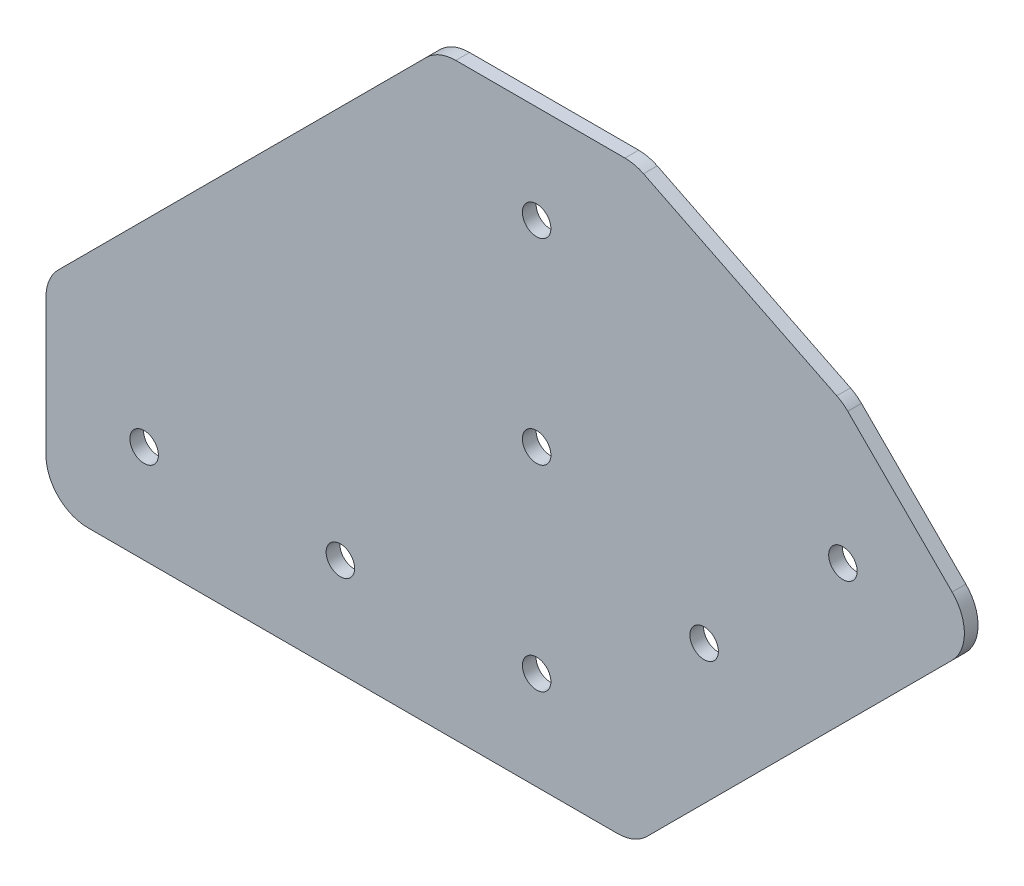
ISO-10303-21;
HEADER;
FILE_DESCRIPTION(('STEP AP214'),'2;1');
FILE_NAME('part.step','',(''),(''),'','','');
FILE_SCHEMA(('AUTOMOTIVE_DESIGN { 1 0 10303 214 1 1 1 1 }'));
ENDSEC;
DATA;
#1=APPLICATION_CONTEXT('core data for automotive mechanical design processes');
#2=APPLICATION_PROTOCOL_DEFINITION('international standard','automotive_design',2000,#1);
#3=PRODUCT_CONTEXT('',#1,'mechanical');
#4=PRODUCT('Part','Part','',(#3));
#5=PRODUCT_RELATED_PRODUCT_CATEGORY('part','',(#4));
#6=PRODUCT_DEFINITION_FORMATION('','',#4);
#7=PRODUCT_DEFINITION_CONTEXT('part definition',#1,'design');
#8=PRODUCT_DEFINITION('design','',#6,#7);
#9=PRODUCT_DEFINITION_SHAPE('','',#8);
#10=(LENGTH_UNIT() NAMED_UNIT(*) SI_UNIT(.MILLI.,.METRE.));
#11=(NAMED_UNIT(*) PLANE_ANGLE_UNIT() SI_UNIT($,.RADIAN.));
#12=(NAMED_UNIT(*) SI_UNIT($,.STERADIAN.) SOLID_ANGLE_UNIT());
#13=UNCERTAINTY_MEASURE_WITH_UNIT(LENGTH_MEASURE(1.E-05),#10,'distance_accuracy_value','');
#14=(GEOMETRIC_REPRESENTATION_CONTEXT(3) GLOBAL_UNCERTAINTY_ASSIGNED_CONTEXT((#13)) GLOBAL_UNIT_ASSIGNED_CONTEXT((#10,
#11,#12)) REPRESENTATION_CONTEXT('',''));
#15=CARTESIAN_POINT('',(0.,0.,0.));
#16=DIRECTION('',(0.,0.,1.));
#17=DIRECTION('',(1.,0.,0.));
#18=AXIS2_PLACEMENT_3D('',#15,#16,#17);
#19=CARTESIAN_POINT('',(0.,0.,0.));
#20=DIRECTION('',(0.,0.,1.));
#21=DIRECTION('',(1.,0.,0.));
#22=AXIS2_PLACEMENT_3D('',#19,#20,#21);
#23=PLANE('',#22);
#24=CARTESIAN_POINT('',(66.1934297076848,4.841875,0.));
#25=DIRECTION('',(0.,0.,-1.));
#26=DIRECTION('',(-1.,0.,0.));
#27=AXIS2_PLACEMENT_3D('',#24,#25,#26);
#28=CIRCLE('',#27,4.841875);
#29=CARTESIAN_POINT('',(66.1934297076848,0.,0.));
#30=VERTEX_POINT('',#29);
#31=CARTESIAN_POINT('',(69.6171523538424,1.4181523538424,0.));
#32=VERTEX_POINT('',#31);
#33=EDGE_CURVE('E122',#30,#32,#28,.F.);
#34=ORIENTED_EDGE('',*,*,#33,.F.);
#35=DIRECTION('',(1.,0.,0.));
#36=VECTOR('',#35,1.);
#37=CARTESIAN_POINT('',(0.,0.,0.));
#38=LINE('',#37,#36);
#39=CARTESIAN_POINT('',(4.841875,0.,0.));
#40=VERTEX_POINT('',#39);
#41=EDGE_CURVE('E114',#30,#40,#38,.F.);
#42=ORIENTED_EDGE('',*,*,#41,.T.);
#43=CARTESIAN_POINT('',(4.841875,4.841875,0.));
#44=DIRECTION('',(0.,0.,-1.));
#45=DIRECTION('',(-1.,0.,0.));
#46=AXIS2_PLACEMENT_3D('',#43,#44,#45);
#47=CIRCLE('',#46,4.841875);
#48=CARTESIAN_POINT('',(0.,4.841875,0.));
#49=VERTEX_POINT('',#48);
#50=EDGE_CURVE('E212',#49,#40,#47,.F.);
#51=ORIENTED_EDGE('',*,*,#50,.F.);
#52=DIRECTION('',(0.,1.,0.));
#53=VECTOR('',#52,1.);
#54=CARTESIAN_POINT('',(0.,22.733,0.));
#55=LINE('',#54,#53);
#56=CARTESIAN_POINT('',(0.,20.7274297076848,0.));
#57=VERTEX_POINT('',#56);
#58=EDGE_CURVE('E149',#49,#57,#55,.T.);
#59=ORIENTED_EDGE('',*,*,#58,.T.);
#60=CARTESIAN_POINT('',(4.841875,20.7274297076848,0.));
#61=DIRECTION('',(0.,0.,-1.));
#62=DIRECTION('',(-1.,0.,0.));
#63=AXIS2_PLACEMENT_3D('',#60,#61,#62);
#64=CIRCLE('',#63,4.841875);
#65=CARTESIAN_POINT('',(1.41815235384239,24.1511523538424,0.));
#66=VERTEX_POINT('',#65);
#67=EDGE_CURVE('E215',#66,#57,#64,.F.);
#68=ORIENTED_EDGE('',*,*,#67,.F.);
#69=DIRECTION('',(0.707106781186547,0.707106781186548,0.));
#70=VECTOR('',#69,1.);
#71=CARTESIAN_POINT('',(45.466,68.199,0.));
#72=LINE('',#71,#70);
#73=CARTESIAN_POINT('',(44.0478476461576,66.7808476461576,0.));
#74=VERTEX_POINT('',#73);
#75=EDGE_CURVE('E153',#66,#74,#72,.T.);
#76=ORIENTED_EDGE('',*,*,#75,.T.);
#77=CARTESIAN_POINT('',(47.4715702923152,63.357125,0.));
#78=DIRECTION('',(0.,0.,-1.));
#79=DIRECTION('',(-1.,0.,0.));
#80=AXIS2_PLACEMENT_3D('',#77,#78,#79);
#81=CIRCLE('',#80,4.841875);
#82=CARTESIAN_POINT('',(47.4715702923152,68.199,0.));
#83=VERTEX_POINT('',#82);
#84=EDGE_CURVE('E156',#83,#74,#81,.F.);
#85=ORIENTED_EDGE('',*,*,#84,.F.);
#86=DIRECTION('',(1.,0.,0.));
#87=VECTOR('',#86,1.);
#88=CARTESIAN_POINT('',(68.199,68.199,0.));
#89=LINE('',#88,#87);
#90=CARTESIAN_POINT('',(67.0660350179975,68.199,0.));
#91=VERTEX_POINT('',#90);
#92=EDGE_CURVE('E157',#83,#91,#89,.T.);
#93=ORIENTED_EDGE('',*,*,#92,.T.);
#94=CARTESIAN_POINT('',(67.0660350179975,63.357125,0.));
#95=DIRECTION('',(0.,0.,-1.));
#96=DIRECTION('',(-1.,0.,0.));
#97=AXIS2_PLACEMENT_3D('',#94,#95,#96);
#98=CIRCLE('',#97,4.841875);
#99=CARTESIAN_POINT('',(69.2143394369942,67.6963117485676,0.));
#100=VERTEX_POINT('',#99);
#101=EDGE_CURVE('E160',#100,#91,#98,.F.);
#102=ORIENTED_EDGE('',*,*,#101,.F.);
#103=DIRECTION('',(0.896179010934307,-0.443692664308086,0.));
#104=VECTOR('',#103,1.);
#105=CARTESIAN_POINT('',(92.3109876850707,56.2613045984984,0.));
#106=LINE('',#105,#104);
#107=CARTESIAN_POINT('',(91.5980748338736,56.6142633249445,0.));
#108=VERTEX_POINT('',#107);
#109=EDGE_CURVE('E161',#100,#108,#106,.T.);
#110=ORIENTED_EDGE('',*,*,#109,.T.);
#111=CARTESIAN_POINT('',(89.4497704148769,52.2750765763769,0.));
#112=DIRECTION('',(0.,0.,-1.));
#113=DIRECTION('',(-1.,0.,0.));
#114=AXIS2_PLACEMENT_3D('',#111,#112,#113);
#115=CIRCLE('',#114,4.841875);
#116=CARTESIAN_POINT('',(92.8734930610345,55.6987992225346,0.));
#117=VERTEX_POINT('',#116);
#118=EDGE_CURVE('E164',#117,#108,#115,.F.);
#119=ORIENTED_EDGE('',*,*,#118,.F.);
#120=DIRECTION('',(0.707106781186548,-0.707106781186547,0.));
#121=VECTOR('',#120,1.);
#122=CARTESIAN_POINT('',(108.385646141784,40.1866461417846,0.));
#123=LINE('',#122,#121);
#124=CARTESIAN_POINT('',(104.961923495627,43.6103687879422,0.));
#125=VERTEX_POINT('',#124);
#126=EDGE_CURVE('E165',#117,#125,#123,.T.);
#127=ORIENTED_EDGE('',*,*,#126,.T.);
#128=CARTESIAN_POINT('',(101.538200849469,40.1866461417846,0.));
#129=DIRECTION('',(0.,0.,-1.));
#130=DIRECTION('',(-1.,0.,0.));
#131=AXIS2_PLACEMENT_3D('',#128,#129,#130);
#132=CIRCLE('',#131,4.841875);
#133=CARTESIAN_POINT('',(104.961923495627,36.762923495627,0.));
#134=VERTEX_POINT('',#133);
#135=EDGE_CURVE('E125',#134,#125,#132,.F.);
#136=ORIENTED_EDGE('',*,*,#135,.F.);
#137=DIRECTION('',(-0.707106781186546,-0.707106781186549,0.));
#138=VECTOR('',#137,1.);
#139=CARTESIAN_POINT('',(68.199,0.,0.));
#140=LINE('',#139,#138);
#141=EDGE_CURVE('E119',#134,#32,#140,.T.);
#142=ORIENTED_EDGE('',*,*,#141,.T.);
#143=EDGE_LOOP('',(#34,#42,#51,#59,#68,#76,#85,#93,#102,#110,#119,#127,#136,#142));
#144=FACE_BOUND('',#143,.T.);
#145=CARTESIAN_POINT('',(56.8325,11.3665,0.));
#146=DIRECTION('',(0.,0.,1.));
#147=DIRECTION('',(1.,0.,0.));
#148=AXIS2_PLACEMENT_3D('',#145,#146,#147);
#149=CIRCLE('',#148,1.65099999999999);
#150=CARTESIAN_POINT('',(58.4835,11.3665,0.));
#151=VERTEX_POINT('',#150);
#152=EDGE_CURVE('E148',#151,#151,#149,.T.);
#153=ORIENTED_EDGE('',*,*,#152,.T.);
#154=EDGE_LOOP('',(#153));
#155=FACE_BOUND('',#154,.T.);
#156=CARTESIAN_POINT('',(92.3109876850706,40.1866461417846,0.));
#157=DIRECTION('',(0.,0.,1.));
#158=DIRECTION('',(1.,0.,0.));
#159=AXIS2_PLACEMENT_3D('',#156,#157,#158);
#160=CIRCLE('',#159,1.65099999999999);
#161=CARTESIAN_POINT('',(93.9619876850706,40.1866461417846,0.));
#162=VERTEX_POINT('',#161);
#163=EDGE_CURVE('E230',#162,#162,#160,.T.);
#164=ORIENTED_EDGE('',*,*,#163,.T.);
#165=EDGE_LOOP('',(#164));
#166=FACE_BOUND('',#165,.T.);
#167=CARTESIAN_POINT('',(76.2363292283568,24.1119876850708,0.));
#168=DIRECTION('',(0.,0.,1.));
#169=DIRECTION('',(1.,0.,0.));
#170=AXIS2_PLACEMENT_3D('',#167,#168,#169);
#171=CIRCLE('',#170,1.65099999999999);
#172=CARTESIAN_POINT('',(77.8873292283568,24.1119876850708,0.));
#173=VERTEX_POINT('',#172);
#174=EDGE_CURVE('E233',#173,#173,#171,.T.);
#175=ORIENTED_EDGE('',*,*,#174,.T.);
#176=EDGE_LOOP('',(#175));
#177=FACE_BOUND('',#176,.T.);
#178=CARTESIAN_POINT('',(34.0995,11.3665,0.));
#179=DIRECTION('',(0.,0.,1.));
#180=DIRECTION('',(1.,0.,0.));
#181=AXIS2_PLACEMENT_3D('',#178,#179,#180);
#182=CIRCLE('',#181,1.65099999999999);
#183=CARTESIAN_POINT('',(35.7505,11.3665,0.));
#184=VERTEX_POINT('',#183);
#185=EDGE_CURVE('E236',#184,#184,#182,.T.);
#186=ORIENTED_EDGE('',*,*,#185,.T.);
#187=EDGE_LOOP('',(#186));
#188=FACE_BOUND('',#187,.T.);
#189=CARTESIAN_POINT('',(11.3665,11.3665,0.));
#190=DIRECTION('',(0.,0.,1.));
#191=DIRECTION('',(1.,0.,0.));
#192=AXIS2_PLACEMENT_3D('',#189,#190,#191);
#193=CIRCLE('',#192,1.65099999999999);
#194=CARTESIAN_POINT('',(13.0175,11.3665,0.));
#195=VERTEX_POINT('',#194);
#196=EDGE_CURVE('E239',#195,#195,#193,.T.);
#197=ORIENTED_EDGE('',*,*,#196,.T.);
#198=EDGE_LOOP('',(#197));
#199=FACE_BOUND('',#198,.T.);
#200=CARTESIAN_POINT('',(56.8325,34.0995,0.));
#201=DIRECTION('',(0.,0.,1.));
#202=DIRECTION('',(1.,0.,0.));
#203=AXIS2_PLACEMENT_3D('',#200,#201,#202);
#204=CIRCLE('',#203,1.65099999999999);
#205=CARTESIAN_POINT('',(58.4835,34.0995,0.));
#206=VERTEX_POINT('',#205);
#207=EDGE_CURVE('E241',#206,#206,#204,.T.);
#208=ORIENTED_EDGE('',*,*,#207,.T.);
#209=EDGE_LOOP('',(#208));
#210=FACE_BOUND('',#209,.T.);
#211=CARTESIAN_POINT('',(56.8325,56.8325,0.));
#212=DIRECTION('',(0.,0.,1.));
#213=DIRECTION('',(1.,0.,0.));
#214=AXIS2_PLACEMENT_3D('',#211,#212,#213);
#215=CIRCLE('',#214,1.65099999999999);
#216=CARTESIAN_POINT('',(58.4835,56.8325,0.));
#217=VERTEX_POINT('',#216);
#218=EDGE_CURVE('E20',#217,#217,#215,.T.);
#219=ORIENTED_EDGE('',*,*,#218,.T.);
#220=EDGE_LOOP('',(#219));
#221=FACE_BOUND('',#220,.T.);
#222=ADVANCED_FACE('F17',(#144,#155,#166,#177,#188,#199,#210,#221),#23,.F.);
#223=CARTESIAN_POINT('',(56.8325,56.8325,1.5875));
#224=DIRECTION('',(0.,0.,1.));
#225=DIRECTION('',(1.,0.,0.));
#226=AXIS2_PLACEMENT_3D('',#223,#224,#225);
#227=CYLINDRICAL_SURFACE('',#226,1.65099999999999);
#228=CARTESIAN_POINT('',(56.8325,56.8325,1.5875));
#229=DIRECTION('',(0.,0.,1.));
#230=DIRECTION('',(1.,0.,0.));
#231=AXIS2_PLACEMENT_3D('',#228,#229,#230);
#232=CIRCLE('',#231,1.65099999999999);
#233=CARTESIAN_POINT('',(58.4835,56.8325,1.5875));
#234=VERTEX_POINT('',#233);
#235=EDGE_CURVE('E208',#234,#234,#232,.F.);
#236=ORIENTED_EDGE('',*,*,#235,.F.);
#237=EDGE_LOOP('',(#236));
#238=FACE_BOUND('',#237,.T.);
#239=ORIENTED_EDGE('',*,*,#218,.F.);
#240=EDGE_LOOP('',(#239));
#241=FACE_BOUND('',#240,.T.);
#242=ADVANCED_FACE('F249',(#238,#241),#227,.F.);
#243=CARTESIAN_POINT('',(56.8325,34.0995,1.5875));
#244=DIRECTION('',(0.,0.,1.));
#245=DIRECTION('',(1.,0.,0.));
#246=AXIS2_PLACEMENT_3D('',#243,#244,#245);
#247=CYLINDRICAL_SURFACE('',#246,1.65099999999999);
#248=CARTESIAN_POINT('',(56.8325,34.0995,1.5875));
#249=DIRECTION('',(0.,0.,1.));
#250=DIRECTION('',(1.,0.,0.));
#251=AXIS2_PLACEMENT_3D('',#248,#249,#250);
#252=CIRCLE('',#251,1.65099999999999);
#253=CARTESIAN_POINT('',(58.4835,34.0995,1.5875));
#254=VERTEX_POINT('',#253);
#255=EDGE_CURVE('E205',#254,#254,#252,.F.);
#256=ORIENTED_EDGE('',*,*,#255,.F.);
#257=EDGE_LOOP('',(#256));
#258=FACE_BOUND('',#257,.T.);
#259=ORIENTED_EDGE('',*,*,#207,.F.);
#260=EDGE_LOOP('',(#259));
#261=FACE_BOUND('',#260,.T.);
#262=ADVANCED_FACE('F251',(#258,#261),#247,.F.);
#263=CARTESIAN_POINT('',(11.3665,11.3665,1.5875));
#264=DIRECTION('',(0.,0.,1.));
#265=DIRECTION('',(1.,0.,0.));
#266=AXIS2_PLACEMENT_3D('',#263,#264,#265);
#267=CYLINDRICAL_SURFACE('',#266,1.65099999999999);
#268=CARTESIAN_POINT('',(11.3665,11.3665,1.5875));
#269=DIRECTION('',(0.,0.,1.));
#270=DIRECTION('',(1.,0.,0.));
#271=AXIS2_PLACEMENT_3D('',#268,#269,#270);
#272=CIRCLE('',#271,1.65099999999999);
#273=CARTESIAN_POINT('',(13.0175,11.3665,1.5875));
#274=VERTEX_POINT('',#273);
#275=EDGE_CURVE('E202',#274,#274,#272,.F.);
#276=ORIENTED_EDGE('',*,*,#275,.F.);
#277=EDGE_LOOP('',(#276));
#278=FACE_BOUND('',#277,.T.);
#279=ORIENTED_EDGE('',*,*,#196,.F.);
#280=EDGE_LOOP('',(#279));
#281=FACE_BOUND('',#280,.T.);
#282=ADVANCED_FACE('F258',(#278,#281),#267,.F.);
#283=CARTESIAN_POINT('',(34.0995,11.3665,1.5875));
#284=DIRECTION('',(0.,0.,1.));
#285=DIRECTION('',(1.,0.,0.));
#286=AXIS2_PLACEMENT_3D('',#283,#284,#285);
#287=CYLINDRICAL_SURFACE('',#286,1.65099999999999);
#288=CARTESIAN_POINT('',(34.0995,11.3665,1.5875));
#289=DIRECTION('',(0.,0.,1.));
#290=DIRECTION('',(1.,0.,0.));
#291=AXIS2_PLACEMENT_3D('',#288,#289,#290);
#292=CIRCLE('',#291,1.65099999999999);
#293=CARTESIAN_POINT('',(35.7505,11.3665,1.5875));
#294=VERTEX_POINT('',#293);
#295=EDGE_CURVE('E199',#294,#294,#292,.F.);
#296=ORIENTED_EDGE('',*,*,#295,.F.);
#297=EDGE_LOOP('',(#296));
#298=FACE_BOUND('',#297,.T.);
#299=ORIENTED_EDGE('',*,*,#185,.F.);
#300=EDGE_LOOP('',(#299));
#301=FACE_BOUND('',#300,.T.);
#302=ADVANCED_FACE('F332',(#298,#301),#287,.F.);
#303=CARTESIAN_POINT('',(76.2363292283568,24.1119876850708,1.5875));
#304=DIRECTION('',(0.,0.,1.));
#305=DIRECTION('',(1.,0.,0.));
#306=AXIS2_PLACEMENT_3D('',#303,#304,#305);
#307=CYLINDRICAL_SURFACE('',#306,1.65099999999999);
#308=CARTESIAN_POINT('',(76.2363292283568,24.1119876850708,1.5875));
#309=DIRECTION('',(0.,0.,1.));
#310=DIRECTION('',(1.,0.,0.));
#311=AXIS2_PLACEMENT_3D('',#308,#309,#310);
#312=CIRCLE('',#311,1.65099999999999);
#313=CARTESIAN_POINT('',(77.8873292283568,24.1119876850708,1.5875));
#314=VERTEX_POINT('',#313);
#315=EDGE_CURVE('E196',#314,#314,#312,.F.);
#316=ORIENTED_EDGE('',*,*,#315,.F.);
#317=EDGE_LOOP('',(#316));
#318=FACE_BOUND('',#317,.T.);
#319=ORIENTED_EDGE('',*,*,#174,.F.);
#320=EDGE_LOOP('',(#319));
#321=FACE_BOUND('',#320,.T.);
#322=ADVANCED_FACE('F328',(#318,#321),#307,.F.);
#323=CARTESIAN_POINT('',(92.3109876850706,40.1866461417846,1.5875));
#324=DIRECTION('',(0.,0.,1.));
#325=DIRECTION('',(1.,0.,0.));
#326=AXIS2_PLACEMENT_3D('',#323,#324,#325);
#327=CYLINDRICAL_SURFACE('',#326,1.65099999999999);
#328=CARTESIAN_POINT('',(92.3109876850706,40.1866461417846,1.5875));
#329=DIRECTION('',(0.,0.,1.));
#330=DIRECTION('',(1.,0.,0.));
#331=AXIS2_PLACEMENT_3D('',#328,#329,#330);
#332=CIRCLE('',#331,1.65099999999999);
#333=CARTESIAN_POINT('',(93.9619876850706,40.1866461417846,1.5875));
#334=VERTEX_POINT('',#333);
#335=EDGE_CURVE('E193',#334,#334,#332,.F.);
#336=ORIENTED_EDGE('',*,*,#335,.F.);
#337=EDGE_LOOP('',(#336));
#338=FACE_BOUND('',#337,.T.);
#339=ORIENTED_EDGE('',*,*,#163,.F.);
#340=EDGE_LOOP('',(#339));
#341=FACE_BOUND('',#340,.T.);
#342=ADVANCED_FACE('F324',(#338,#341),#327,.F.);
#343=CARTESIAN_POINT('',(56.8325,11.3665,1.5875));
#344=DIRECTION('',(0.,0.,1.));
#345=DIRECTION('',(1.,0.,0.));
#346=AXIS2_PLACEMENT_3D('',#343,#344,#345);
#347=CYLINDRICAL_SURFACE('',#346,1.65099999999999);
#348=CARTESIAN_POINT('',(56.8325,11.3665,1.5875));
#349=DIRECTION('',(0.,0.,1.));
#350=DIRECTION('',(1.,0.,0.));
#351=AXIS2_PLACEMENT_3D('',#348,#349,#350);
#352=CIRCLE('',#351,1.65099999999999);
#353=CARTESIAN_POINT('',(58.4835,11.3665,1.5875));
#354=VERTEX_POINT('',#353);
#355=EDGE_CURVE('E190',#354,#354,#352,.F.);
#356=ORIENTED_EDGE('',*,*,#355,.F.);
#357=EDGE_LOOP('',(#356));
#358=FACE_BOUND('',#357,.T.);
#359=ORIENTED_EDGE('',*,*,#152,.F.);
#360=EDGE_LOOP('',(#359));
#361=FACE_BOUND('',#360,.T.);
#362=ADVANCED_FACE('F321',(#358,#361),#347,.F.);
#363=CARTESIAN_POINT('',(0.,0.,1.5875));
#364=DIRECTION('',(0.,1.,0.));
#365=DIRECTION('',(0.,0.,1.));
#366=AXIS2_PLACEMENT_3D('',#363,#364,#365);
#367=PLANE('',#366);
#368=DIRECTION('',(0.,0.,-1.));
#369=VECTOR('',#368,1.);
#370=CARTESIAN_POINT('',(66.1934297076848,0.,1.5875));
#371=LINE('',#370,#369);
#372=CARTESIAN_POINT('',(66.1934297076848,0.,1.5875));
#373=VERTEX_POINT('',#372);
#374=EDGE_CURVE('E135',#373,#30,#371,.T.);
#375=ORIENTED_EDGE('',*,*,#374,.F.);
#376=DIRECTION('',(1.,0.,0.));
#377=VECTOR('',#376,1.);
#378=CARTESIAN_POINT('',(0.,0.,1.5875));
#379=LINE('',#378,#377);
#380=CARTESIAN_POINT('',(4.841875,0.,1.5875));
#381=VERTEX_POINT('',#380);
#382=EDGE_CURVE('E189',#381,#373,#379,.T.);
#383=ORIENTED_EDGE('',*,*,#382,.F.);
#384=DIRECTION('',(0.,0.,-1.));
#385=VECTOR('',#384,1.);
#386=CARTESIAN_POINT('',(4.841875,0.,1.5875));
#387=LINE('',#386,#385);
#388=EDGE_CURVE('E211',#40,#381,#387,.F.);
#389=ORIENTED_EDGE('',*,*,#388,.F.);
#390=ORIENTED_EDGE('',*,*,#41,.F.);
#391=EDGE_LOOP('',(#375,#383,#389,#390));
#392=FACE_BOUND('',#391,.T.);
#393=ADVANCED_FACE('F318',(#392),#367,.F.);
#394=CARTESIAN_POINT('',(66.1934297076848,4.841875,1.5875));
#395=DIRECTION('',(0.,0.,-1.));
#396=DIRECTION('',(-1.,0.,0.));
#397=AXIS2_PLACEMENT_3D('',#394,#395,#396);
#398=CYLINDRICAL_SURFACE('',#397,4.841875);
#399=ORIENTED_EDGE('',*,*,#33,.T.);
#400=DIRECTION('',(0.,0.,1.));
#401=VECTOR('',#400,1.);
#402=CARTESIAN_POINT('',(69.6171523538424,1.4181523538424,1.5875));
#403=LINE('',#402,#401);
#404=CARTESIAN_POINT('',(69.6171523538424,1.4181523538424,1.5875));
#405=VERTEX_POINT('',#404);
#406=EDGE_CURVE('E129',#32,#405,#403,.T.);
#407=ORIENTED_EDGE('',*,*,#406,.T.);
#408=CARTESIAN_POINT('',(66.1934297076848,4.841875,1.5875));
#409=DIRECTION('',(0.,0.,-1.));
#410=DIRECTION('',(-1.,0.,0.));
#411=AXIS2_PLACEMENT_3D('',#408,#409,#410);
#412=CIRCLE('',#411,4.841875);
#413=EDGE_CURVE('E187',#373,#405,#412,.F.);
#414=ORIENTED_EDGE('',*,*,#413,.F.);
#415=ORIENTED_EDGE('',*,*,#374,.T.);
#416=EDGE_LOOP('',(#399,#407,#414,#415));
#417=FACE_BOUND('',#416,.T.);
#418=ADVANCED_FACE('F132',(#417),#398,.T.);
#419=CARTESIAN_POINT('',(68.199,0.,1.5875));
#420=DIRECTION('',(-0.707106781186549,0.707106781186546,0.));
#421=DIRECTION('',(-0.707106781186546,-0.707106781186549,0.));
#422=AXIS2_PLACEMENT_3D('',#419,#420,#421);
#423=PLANE('',#422);
#424=ORIENTED_EDGE('',*,*,#406,.F.);
#425=ORIENTED_EDGE('',*,*,#141,.F.);
#426=DIRECTION('',(0.,0.,-1.));
#427=VECTOR('',#426,1.);
#428=CARTESIAN_POINT('',(104.961923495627,36.762923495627,1.5875));
#429=LINE('',#428,#427);
#430=CARTESIAN_POINT('',(104.961923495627,36.762923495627,1.5875));
#431=VERTEX_POINT('',#430);
#432=EDGE_CURVE('E141',#431,#134,#429,.T.);
#433=ORIENTED_EDGE('',*,*,#432,.F.);
#434=DIRECTION('',(0.707106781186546,0.707106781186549,0.));
#435=VECTOR('',#434,1.);
#436=CARTESIAN_POINT('',(69.6171523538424,1.4181523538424,1.5875));
#437=LINE('',#436,#435);
#438=EDGE_CURVE('E139',#405,#431,#437,.T.);
#439=ORIENTED_EDGE('',*,*,#438,.F.);
#440=EDGE_LOOP('',(#424,#425,#433,#439));
#441=FACE_BOUND('',#440,.T.);
#442=ADVANCED_FACE('F137',(#441),#423,.F.);
#443=CARTESIAN_POINT('',(101.538200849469,40.1866461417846,1.5875));
#444=DIRECTION('',(0.,0.,-1.));
#445=DIRECTION('',(-1.,0.,0.));
#446=AXIS2_PLACEMENT_3D('',#443,#444,#445);
#447=CYLINDRICAL_SURFACE('',#446,4.841875);
#448=ORIENTED_EDGE('',*,*,#135,.T.);
#449=DIRECTION('',(0.,0.,1.));
#450=VECTOR('',#449,1.);
#451=CARTESIAN_POINT('',(104.961923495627,43.6103687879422,1.5875));
#452=LINE('',#451,#450);
#453=CARTESIAN_POINT('',(104.961923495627,43.6103687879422,1.5875));
#454=VERTEX_POINT('',#453);
#455=EDGE_CURVE('E166',#125,#454,#452,.T.);
#456=ORIENTED_EDGE('',*,*,#455,.T.);
#457=CARTESIAN_POINT('',(101.538200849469,40.1866461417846,1.5875));
#458=DIRECTION('',(0.,0.,-1.));
#459=DIRECTION('',(-1.,0.,0.));
#460=AXIS2_PLACEMENT_3D('',#457,#458,#459);
#461=CIRCLE('',#460,4.841875);
#462=EDGE_CURVE('E184',#431,#454,#461,.F.);
#463=ORIENTED_EDGE('',*,*,#462,.F.);
#464=ORIENTED_EDGE('',*,*,#432,.T.);
#465=EDGE_LOOP('',(#448,#456,#463,#464));
#466=FACE_BOUND('',#465,.T.);
#467=ADVANCED_FACE('F309',(#466),#447,.T.);
#468=CARTESIAN_POINT('',(108.385646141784,40.1866461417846,1.5875));
#469=DIRECTION('',(-0.707106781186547,-0.707106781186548,0.));
#470=DIRECTION('',(0.707106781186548,-0.707106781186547,0.));
#471=AXIS2_PLACEMENT_3D('',#468,#469,#470);
#472=PLANE('',#471);
#473=ORIENTED_EDGE('',*,*,#455,.F.);
#474=ORIENTED_EDGE('',*,*,#126,.F.);
#475=DIRECTION('',(0.,0.,-1.));
#476=VECTOR('',#475,1.);
#477=CARTESIAN_POINT('',(92.8734930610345,55.6987992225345,1.5875));
#478=LINE('',#477,#476);
#479=CARTESIAN_POINT('',(92.8734930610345,55.6987992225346,1.5875));
#480=VERTEX_POINT('',#479);
#481=EDGE_CURVE('E226',#480,#117,#478,.T.);
#482=ORIENTED_EDGE('',*,*,#481,.F.);
#483=DIRECTION('',(-0.707106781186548,0.707106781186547,0.));
#484=VECTOR('',#483,1.);
#485=CARTESIAN_POINT('',(104.961923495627,43.6103687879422,1.5875));
#486=LINE('',#485,#484);
#487=EDGE_CURVE('E183',#454,#480,#486,.T.);
#488=ORIENTED_EDGE('',*,*,#487,.F.);
#489=EDGE_LOOP('',(#473,#474,#482,#488));
#490=FACE_BOUND('',#489,.T.);
#491=ADVANCED_FACE('F305',(#490),#472,.F.);
#492=CARTESIAN_POINT('',(89.4497704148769,52.2750765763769,1.5875));
#493=DIRECTION('',(0.,0.,-1.));
#494=DIRECTION('',(-1.,0.,0.));
#495=AXIS2_PLACEMENT_3D('',#492,#493,#494);
#496=CYLINDRICAL_SURFACE('',#495,4.841875);
#497=ORIENTED_EDGE('',*,*,#118,.T.);
#498=DIRECTION('',(0.,0.,1.));
#499=VECTOR('',#498,1.);
#500=CARTESIAN_POINT('',(91.5980748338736,56.6142633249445,1.5875));
#501=LINE('',#500,#499);
#502=CARTESIAN_POINT('',(91.5980748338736,56.6142633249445,1.5875));
#503=VERTEX_POINT('',#502);
#504=EDGE_CURVE('E163',#108,#503,#501,.T.);
#505=ORIENTED_EDGE('',*,*,#504,.T.);
#506=CARTESIAN_POINT('',(89.4497704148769,52.2750765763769,1.5875));
#507=DIRECTION('',(0.,0.,-1.));
#508=DIRECTION('',(-1.,0.,0.));
#509=AXIS2_PLACEMENT_3D('',#506,#507,#508);
#510=CIRCLE('',#509,4.841875);
#511=EDGE_CURVE('E180',#480,#503,#510,.F.);
#512=ORIENTED_EDGE('',*,*,#511,.F.);
#513=ORIENTED_EDGE('',*,*,#481,.T.);
#514=EDGE_LOOP('',(#497,#505,#512,#513));
#515=FACE_BOUND('',#514,.T.);
#516=ADVANCED_FACE('F301',(#515),#496,.T.);
#517=CARTESIAN_POINT('',(92.3109876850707,56.2613045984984,1.5875));
#518=DIRECTION('',(-0.443692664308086,-0.896179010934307,0.));
#519=DIRECTION('',(0.896179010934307,-0.443692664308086,0.));
#520=AXIS2_PLACEMENT_3D('',#517,#518,#519);
#521=PLANE('',#520);
#522=ORIENTED_EDGE('',*,*,#504,.F.);
#523=ORIENTED_EDGE('',*,*,#109,.F.);
#524=DIRECTION('',(0.,0.,-1.));
#525=VECTOR('',#524,1.);
#526=CARTESIAN_POINT('',(69.2143394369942,67.6963117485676,1.5875));
#527=LINE('',#526,#525);
#528=CARTESIAN_POINT('',(69.2143394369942,67.6963117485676,1.5875));
#529=VERTEX_POINT('',#528);
#530=EDGE_CURVE('E223',#529,#100,#527,.T.);
#531=ORIENTED_EDGE('',*,*,#530,.F.);
#532=DIRECTION('',(-0.896179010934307,0.443692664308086,0.));
#533=VECTOR('',#532,1.);
#534=CARTESIAN_POINT('',(91.5980748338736,56.6142633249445,1.5875));
#535=LINE('',#534,#533);
#536=EDGE_CURVE('E179',#503,#529,#535,.T.);
#537=ORIENTED_EDGE('',*,*,#536,.F.);
#538=EDGE_LOOP('',(#522,#523,#531,#537));
#539=FACE_BOUND('',#538,.T.);
#540=ADVANCED_FACE('F297',(#539),#521,.F.);
#541=CARTESIAN_POINT('',(67.0660350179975,63.357125,1.5875));
#542=DIRECTION('',(0.,0.,-1.));
#543=DIRECTION('',(-1.,0.,0.));
#544=AXIS2_PLACEMENT_3D('',#541,#542,#543);
#545=CYLINDRICAL_SURFACE('',#544,4.841875);
#546=ORIENTED_EDGE('',*,*,#101,.T.);
#547=DIRECTION('',(0.,0.,-1.));
#548=VECTOR('',#547,1.);
#549=CARTESIAN_POINT('',(67.0660350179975,68.199,1.5875));
#550=LINE('',#549,#548);
#551=CARTESIAN_POINT('',(67.0660350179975,68.199,1.5875));
#552=VERTEX_POINT('',#551);
#553=EDGE_CURVE('E159',#91,#552,#550,.F.);
#554=ORIENTED_EDGE('',*,*,#553,.T.);
#555=CARTESIAN_POINT('',(67.0660350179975,63.357125,1.5875));
#556=DIRECTION('',(0.,0.,-1.));
#557=DIRECTION('',(-1.,0.,0.));
#558=AXIS2_PLACEMENT_3D('',#555,#556,#557);
#559=CIRCLE('',#558,4.841875);
#560=EDGE_CURVE('E176',#529,#552,#559,.F.);
#561=ORIENTED_EDGE('',*,*,#560,.F.);
#562=ORIENTED_EDGE('',*,*,#530,.T.);
#563=EDGE_LOOP('',(#546,#554,#561,#562));
#564=FACE_BOUND('',#563,.T.);
#565=ADVANCED_FACE('F293',(#564),#545,.T.);
#566=CARTESIAN_POINT('',(68.199,68.199,1.5875));
#567=DIRECTION('',(0.,-1.,0.));
#568=DIRECTION('',(0.,0.,-1.));
#569=AXIS2_PLACEMENT_3D('',#566,#567,#568);
#570=PLANE('',#569);
#571=ORIENTED_EDGE('',*,*,#553,.F.);
#572=ORIENTED_EDGE('',*,*,#92,.F.);
#573=DIRECTION('',(0.,0.,-1.));
#574=VECTOR('',#573,1.);
#575=CARTESIAN_POINT('',(47.4715702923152,68.199,1.5875));
#576=LINE('',#575,#574);
#577=CARTESIAN_POINT('',(47.4715702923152,68.199,1.5875));
#578=VERTEX_POINT('',#577);
#579=EDGE_CURVE('E220',#578,#83,#576,.T.);
#580=ORIENTED_EDGE('',*,*,#579,.F.);
#581=DIRECTION('',(1.,0.,0.));
#582=VECTOR('',#581,1.);
#583=CARTESIAN_POINT('',(0.,68.199,1.5875));
#584=LINE('',#583,#582);
#585=EDGE_CURVE('E175',#552,#578,#584,.F.);
#586=ORIENTED_EDGE('',*,*,#585,.F.);
#587=EDGE_LOOP('',(#571,#572,#580,#586));
#588=FACE_BOUND('',#587,.T.);
#589=ADVANCED_FACE('F289',(#588),#570,.F.);
#590=CARTESIAN_POINT('',(47.4715702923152,63.357125,1.5875));
#591=DIRECTION('',(0.,0.,-1.));
#592=DIRECTION('',(-1.,0.,0.));
#593=AXIS2_PLACEMENT_3D('',#590,#591,#592);
#594=CYLINDRICAL_SURFACE('',#593,4.841875);
#595=ORIENTED_EDGE('',*,*,#84,.T.);
#596=DIRECTION('',(0.,0.,1.));
#597=VECTOR('',#596,1.);
#598=CARTESIAN_POINT('',(44.0478476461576,66.7808476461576,1.5875));
#599=LINE('',#598,#597);
#600=CARTESIAN_POINT('',(44.0478476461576,66.7808476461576,1.5875));
#601=VERTEX_POINT('',#600);
#602=EDGE_CURVE('E155',#74,#601,#599,.T.);
#603=ORIENTED_EDGE('',*,*,#602,.T.);
#604=CARTESIAN_POINT('',(47.4715702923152,63.357125,1.5875));
#605=DIRECTION('',(0.,0.,-1.));
#606=DIRECTION('',(-1.,0.,0.));
#607=AXIS2_PLACEMENT_3D('',#604,#605,#606);
#608=CIRCLE('',#607,4.841875);
#609=EDGE_CURVE('E172',#578,#601,#608,.F.);
#610=ORIENTED_EDGE('',*,*,#609,.F.);
#611=ORIENTED_EDGE('',*,*,#579,.T.);
#612=EDGE_LOOP('',(#595,#603,#610,#611));
#613=FACE_BOUND('',#612,.T.);
#614=ADVANCED_FACE('F285',(#613),#594,.T.);
#615=CARTESIAN_POINT('',(45.466,68.199,1.5875));
#616=DIRECTION('',(0.707106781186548,-0.707106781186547,0.));
#617=DIRECTION('',(0.707106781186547,0.707106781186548,0.));
#618=AXIS2_PLACEMENT_3D('',#615,#616,#617);
#619=PLANE('',#618);
#620=ORIENTED_EDGE('',*,*,#602,.F.);
#621=ORIENTED_EDGE('',*,*,#75,.F.);
#622=DIRECTION('',(0.,0.,-1.));
#623=VECTOR('',#622,1.);
#624=CARTESIAN_POINT('',(1.41815235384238,24.1511523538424,1.5875));
#625=LINE('',#624,#623);
#626=CARTESIAN_POINT('',(1.41815235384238,24.1511523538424,1.5875));
#627=VERTEX_POINT('',#626);
#628=EDGE_CURVE('E217',#627,#66,#625,.T.);
#629=ORIENTED_EDGE('',*,*,#628,.F.);
#630=DIRECTION('',(-0.707106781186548,-0.707106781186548,0.));
#631=VECTOR('',#630,1.);
#632=CARTESIAN_POINT('',(44.0478476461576,66.7808476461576,1.5875));
#633=LINE('',#632,#631);
#634=EDGE_CURVE('E171',#601,#627,#633,.T.);
#635=ORIENTED_EDGE('',*,*,#634,.F.);
#636=EDGE_LOOP('',(#620,#621,#629,#635));
#637=FACE_BOUND('',#636,.T.);
#638=ADVANCED_FACE('F281',(#637),#619,.F.);
#639=CARTESIAN_POINT('',(4.841875,20.7274297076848,1.5875));
#640=DIRECTION('',(0.,0.,-1.));
#641=DIRECTION('',(-1.,0.,0.));
#642=AXIS2_PLACEMENT_3D('',#639,#640,#641);
#643=CYLINDRICAL_SURFACE('',#642,4.841875);
#644=ORIENTED_EDGE('',*,*,#67,.T.);
#645=DIRECTION('',(0.,0.,1.));
#646=VECTOR('',#645,1.);
#647=CARTESIAN_POINT('',(0.,20.7274297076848,1.5875));
#648=LINE('',#647,#646);
#649=CARTESIAN_POINT('',(0.,20.7274297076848,1.5875));
#650=VERTEX_POINT('',#649);
#651=EDGE_CURVE('E152',#57,#650,#648,.T.);
#652=ORIENTED_EDGE('',*,*,#651,.T.);
#653=CARTESIAN_POINT('',(4.841875,20.7274297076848,1.5875));
#654=DIRECTION('',(0.,0.,-1.));
#655=DIRECTION('',(-1.,0.,0.));
#656=AXIS2_PLACEMENT_3D('',#653,#654,#655);
#657=CIRCLE('',#656,4.841875);
#658=EDGE_CURVE('E168',#627,#650,#657,.F.);
#659=ORIENTED_EDGE('',*,*,#658,.F.);
#660=ORIENTED_EDGE('',*,*,#628,.T.);
#661=EDGE_LOOP('',(#644,#652,#659,#660));
#662=FACE_BOUND('',#661,.T.);
#663=ADVANCED_FACE('F278',(#662),#643,.T.);
#664=CARTESIAN_POINT('',(0.,22.733,1.5875));
#665=DIRECTION('',(1.,0.,0.));
#666=DIRECTION('',(0.,1.,0.));
#667=AXIS2_PLACEMENT_3D('',#664,#665,#666);
#668=PLANE('',#667);
#669=DIRECTION('',(0.,0.,-1.));
#670=VECTOR('',#669,1.);
#671=CARTESIAN_POINT('',(0.,4.841875,1.5875));
#672=LINE('',#671,#670);
#673=CARTESIAN_POINT('',(0.,4.841875,1.5875));
#674=VERTEX_POINT('',#673);
#675=EDGE_CURVE('E35',#674,#49,#672,.T.);
#676=ORIENTED_EDGE('',*,*,#675,.F.);
#677=DIRECTION('',(0.,1.,0.));
#678=VECTOR('',#677,1.);
#679=CARTESIAN_POINT('',(0.,0.,1.5875));
#680=LINE('',#679,#678);
#681=EDGE_CURVE('E26',#650,#674,#680,.F.);
#682=ORIENTED_EDGE('',*,*,#681,.F.);
#683=ORIENTED_EDGE('',*,*,#651,.F.);
#684=ORIENTED_EDGE('',*,*,#58,.F.);
#685=EDGE_LOOP('',(#676,#682,#683,#684));
#686=FACE_BOUND('',#685,.T.);
#687=ADVANCED_FACE('F270',(#686),#668,.F.);
#688=CARTESIAN_POINT('',(4.841875,4.841875,1.5875));
#689=DIRECTION('',(0.,0.,-1.));
#690=DIRECTION('',(-1.,0.,0.));
#691=AXIS2_PLACEMENT_3D('',#688,#689,#690);
#692=CYLINDRICAL_SURFACE('',#691,4.841875);
#693=ORIENTED_EDGE('',*,*,#50,.T.);
#694=ORIENTED_EDGE('',*,*,#388,.T.);
#695=CARTESIAN_POINT('',(4.841875,4.841875,1.5875));
#696=DIRECTION('',(0.,0.,-1.));
#697=DIRECTION('',(-1.,0.,0.));
#698=AXIS2_PLACEMENT_3D('',#695,#696,#697);
#699=CIRCLE('',#698,4.841875);
#700=EDGE_CURVE('E10',#674,#381,#699,.F.);
#701=ORIENTED_EDGE('',*,*,#700,.F.);
#702=ORIENTED_EDGE('',*,*,#675,.T.);
#703=EDGE_LOOP('',(#693,#694,#701,#702));
#704=FACE_BOUND('',#703,.T.);
#705=ADVANCED_FACE('F264',(#704),#692,.T.);
#706=CARTESIAN_POINT('',(0.,0.,1.5875));
#707=DIRECTION('',(0.,0.,1.));
#708=DIRECTION('',(1.,0.,0.));
#709=AXIS2_PLACEMENT_3D('',#706,#707,#708);
#710=PLANE('',#709);
#711=ORIENTED_EDGE('',*,*,#681,.T.);
#712=ORIENTED_EDGE('',*,*,#700,.T.);
#713=ORIENTED_EDGE('',*,*,#382,.T.);
#714=ORIENTED_EDGE('',*,*,#413,.T.);
#715=ORIENTED_EDGE('',*,*,#438,.T.);
#716=ORIENTED_EDGE('',*,*,#462,.T.);
#717=ORIENTED_EDGE('',*,*,#487,.T.);
#718=ORIENTED_EDGE('',*,*,#511,.T.);
#719=ORIENTED_EDGE('',*,*,#536,.T.);
#720=ORIENTED_EDGE('',*,*,#560,.T.);
#721=ORIENTED_EDGE('',*,*,#585,.T.);
#722=ORIENTED_EDGE('',*,*,#609,.T.);
#723=ORIENTED_EDGE('',*,*,#634,.T.);
#724=ORIENTED_EDGE('',*,*,#658,.T.);
#725=EDGE_LOOP('',(#711,#712,#713,#714,#715,#716,#717,#718,#719,#720,#721,#722,#723,#724));
#726=FACE_BOUND('',#725,.T.);
#727=ORIENTED_EDGE('',*,*,#355,.T.);
#728=EDGE_LOOP('',(#727));
#729=FACE_BOUND('',#728,.T.);
#730=ORIENTED_EDGE('',*,*,#335,.T.);
#731=EDGE_LOOP('',(#730));
#732=FACE_BOUND('',#731,.T.);
#733=ORIENTED_EDGE('',*,*,#315,.T.);
#734=EDGE_LOOP('',(#733));
#735=FACE_BOUND('',#734,.T.);
#736=ORIENTED_EDGE('',*,*,#295,.T.);
#737=EDGE_LOOP('',(#736));
#738=FACE_BOUND('',#737,.T.);
#739=ORIENTED_EDGE('',*,*,#275,.T.);
#740=EDGE_LOOP('',(#739));
#741=FACE_BOUND('',#740,.T.);
#742=ORIENTED_EDGE('',*,*,#255,.T.);
#743=EDGE_LOOP('',(#742));
#744=FACE_BOUND('',#743,.T.);
#745=ORIENTED_EDGE('',*,*,#235,.T.);
#746=EDGE_LOOP('',(#745));
#747=FACE_BOUND('',#746,.T.);
#748=ADVANCED_FACE('F262',(#726,#729,#732,#735,#738,#741,#744,#747),#710,.T.);
#749=CLOSED_SHELL('',(#222,#242,#262,#282,#302,#322,#342,#362,#393,#418,#442,#467,#491,#516,
#540,#565,#589,#614,#638,#663,#687,#705,#748));
#750=MANIFOLD_SOLID_BREP('B1',#749);
#751=ADVANCED_BREP_SHAPE_REPRESENTATION('',(#18,#750),#14);
#752=SHAPE_DEFINITION_REPRESENTATION(#9,#751);
ENDSEC;
END-ISO-10303-21;
